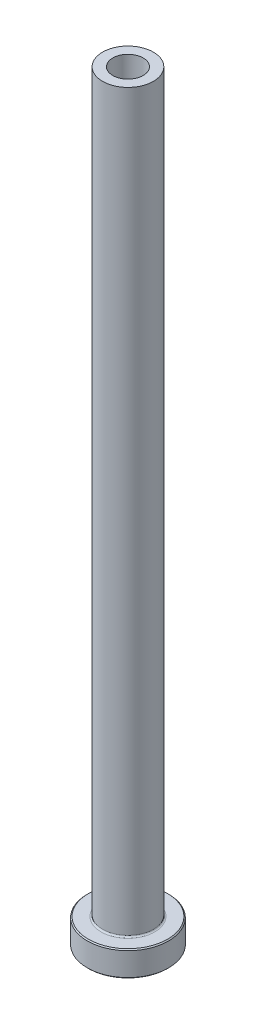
ISO-10303-21;
HEADER;
FILE_DESCRIPTION(('STEP AP214'),'2;1');
FILE_NAME('part.step','',(''),(''),'','','');
FILE_SCHEMA(('AUTOMOTIVE_DESIGN { 1 0 10303 214 1 1 1 1 }'));
ENDSEC;
DATA;
#1=APPLICATION_CONTEXT('core data for automotive mechanical design processes');
#2=APPLICATION_PROTOCOL_DEFINITION('international standard','automotive_design',2000,#1);
#3=PRODUCT_CONTEXT('',#1,'mechanical');
#4=PRODUCT('Part','Part','',(#3));
#5=PRODUCT_RELATED_PRODUCT_CATEGORY('part','',(#4));
#6=PRODUCT_DEFINITION_FORMATION('','',#4);
#7=PRODUCT_DEFINITION_CONTEXT('part definition',#1,'design');
#8=PRODUCT_DEFINITION('design','',#6,#7);
#9=PRODUCT_DEFINITION_SHAPE('','',#8);
#10=(LENGTH_UNIT() NAMED_UNIT(*) SI_UNIT(.MILLI.,.METRE.));
#11=(NAMED_UNIT(*) PLANE_ANGLE_UNIT() SI_UNIT($,.RADIAN.));
#12=(NAMED_UNIT(*) SI_UNIT($,.STERADIAN.) SOLID_ANGLE_UNIT());
#13=UNCERTAINTY_MEASURE_WITH_UNIT(LENGTH_MEASURE(1.E-05),#10,'distance_accuracy_value','');
#14=(GEOMETRIC_REPRESENTATION_CONTEXT(3) GLOBAL_UNCERTAINTY_ASSIGNED_CONTEXT((#13)) GLOBAL_UNIT_ASSIGNED_CONTEXT((#10,
#11,#12)) REPRESENTATION_CONTEXT('',''));
#15=CARTESIAN_POINT('',(0.,0.,0.));
#16=DIRECTION('',(0.,0.,1.));
#17=DIRECTION('',(1.,0.,0.));
#18=AXIS2_PLACEMENT_3D('',#15,#16,#17);
#19=CARTESIAN_POINT('',(0.,92.1876809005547,0.));
#20=DIRECTION('',(0.,1.,0.));
#21=DIRECTION('',(0.,0.,1.));
#22=AXIS2_PLACEMENT_3D('',#19,#20,#21);
#23=CYLINDRICAL_SURFACE('',#22,3.);
#24=CARTESIAN_POINT('',(0.,150.,0.));
#25=DIRECTION('',(0.,1.,0.));
#26=DIRECTION('',(0.,0.,1.));
#27=AXIS2_PLACEMENT_3D('',#24,#25,#26);
#28=CIRCLE('',#27,3.);
#29=CARTESIAN_POINT('',(0.,150.,3.));
#30=VERTEX_POINT('',#29);
#31=EDGE_CURVE('E62',#30,#30,#28,.T.);
#32=ORIENTED_EDGE('',*,*,#31,.T.);
#33=EDGE_LOOP('',(#32));
#34=FACE_BOUND('',#33,.T.);
#35=CARTESIAN_POINT('',(0.,105.,0.));
#36=DIRECTION('',(0.,1.,0.));
#37=DIRECTION('',(0.,0.,1.));
#38=AXIS2_PLACEMENT_3D('',#35,#36,#37);
#39=CIRCLE('',#38,3.);
#40=CARTESIAN_POINT('',(0.,105.,3.));
#41=VERTEX_POINT('',#40);
#42=EDGE_CURVE('E71',#41,#41,#39,.T.);
#43=ORIENTED_EDGE('',*,*,#42,.F.);
#44=EDGE_LOOP('',(#43));
#45=FACE_BOUND('',#44,.T.);
#46=ADVANCED_FACE('F30',(#34,#45),#23,.F.);
#47=CARTESIAN_POINT('',(-3.,150.,0.));
#48=DIRECTION('',(0.,1.,0.));
#49=DIRECTION('',(0.,0.,1.));
#50=AXIS2_PLACEMENT_3D('',#47,#48,#49);
#51=PLANE('',#50);
#52=CARTESIAN_POINT('',(0.,150.,0.));
#53=DIRECTION('',(0.,1.,0.));
#54=DIRECTION('',(0.,0.,1.));
#55=AXIS2_PLACEMENT_3D('',#52,#53,#54);
#56=CIRCLE('',#55,5.00000000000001);
#57=CARTESIAN_POINT('',(0.,150.,5.00000000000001));
#58=VERTEX_POINT('',#57);
#59=EDGE_CURVE('E65',#58,#58,#56,.T.);
#60=ORIENTED_EDGE('',*,*,#59,.T.);
#61=EDGE_LOOP('',(#60));
#62=FACE_BOUND('',#61,.T.);
#63=ORIENTED_EDGE('',*,*,#31,.F.);
#64=EDGE_LOOP('',(#63));
#65=FACE_BOUND('',#64,.T.);
#66=ADVANCED_FACE('F79',(#62,#65),#51,.T.);
#67=CARTESIAN_POINT('',(0.,92.1876809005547,0.));
#68=DIRECTION('',(0.,1.,0.));
#69=DIRECTION('',(0.,0.,1.));
#70=AXIS2_PLACEMENT_3D('',#67,#68,#69);
#71=CYLINDRICAL_SURFACE('',#70,5.);
#72=CARTESIAN_POINT('',(0.,5.3,0.));
#73=DIRECTION('',(0.,1.,0.));
#74=DIRECTION('',(0.,0.,1.));
#75=AXIS2_PLACEMENT_3D('',#72,#73,#74);
#76=CIRCLE('',#75,5.);
#77=CARTESIAN_POINT('',(0.,5.3,5.));
#78=VERTEX_POINT('',#77);
#79=EDGE_CURVE('E59',#78,#78,#76,.T.);
#80=ORIENTED_EDGE('',*,*,#79,.T.);
#81=EDGE_LOOP('',(#80));
#82=FACE_BOUND('',#81,.T.);
#83=ORIENTED_EDGE('',*,*,#59,.F.);
#84=EDGE_LOOP('',(#83));
#85=FACE_BOUND('',#84,.T.);
#86=ADVANCED_FACE('F85',(#82,#85),#71,.T.);
#87=CARTESIAN_POINT('',(-4.99999999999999,5.,0.));
#88=DIRECTION('',(0.,1.,0.));
#89=DIRECTION('',(0.,0.,1.));
#90=AXIS2_PLACEMENT_3D('',#87,#88,#89);
#91=PLANE('',#90);
#92=CARTESIAN_POINT('',(0.,5.,0.));
#93=DIRECTION('',(0.,1.,0.));
#94=DIRECTION('',(0.,0.,1.));
#95=AXIS2_PLACEMENT_3D('',#92,#93,#94);
#96=CIRCLE('',#95,7.79999999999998);
#97=CARTESIAN_POINT('',(0.,5.,7.79999999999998));
#98=VERTEX_POINT('',#97);
#99=EDGE_CURVE('E53',#98,#98,#96,.T.);
#100=ORIENTED_EDGE('',*,*,#99,.T.);
#101=EDGE_LOOP('',(#100));
#102=FACE_BOUND('',#101,.T.);
#103=CARTESIAN_POINT('',(0.,5.,0.));
#104=DIRECTION('',(0.,1.,0.));
#105=DIRECTION('',(0.,0.,1.));
#106=AXIS2_PLACEMENT_3D('',#103,#104,#105);
#107=CIRCLE('',#106,5.3);
#108=CARTESIAN_POINT('',(0.,5.,5.3));
#109=VERTEX_POINT('',#108);
#110=EDGE_CURVE('E56',#109,#109,#107,.F.);
#111=ORIENTED_EDGE('',*,*,#110,.T.);
#112=EDGE_LOOP('',(#111));
#113=FACE_BOUND('',#112,.T.);
#114=ADVANCED_FACE('F111',(#102,#113),#91,.T.);
#115=CARTESIAN_POINT('',(0.,92.1876809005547,0.));
#116=DIRECTION('',(0.,1.,0.));
#117=DIRECTION('',(0.,0.,1.));
#118=AXIS2_PLACEMENT_3D('',#115,#116,#117);
#119=CYLINDRICAL_SURFACE('',#118,7.99999999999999);
#120=CARTESIAN_POINT('',(0.,4.79999999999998,0.));
#121=DIRECTION('',(0.,1.,0.));
#122=DIRECTION('',(0.,0.,1.));
#123=AXIS2_PLACEMENT_3D('',#120,#121,#122);
#124=CIRCLE('',#123,7.99999999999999);
#125=CARTESIAN_POINT('',(0.,4.79999999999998,7.99999999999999));
#126=VERTEX_POINT('',#125);
#127=EDGE_CURVE('E45',#126,#126,#124,.F.);
#128=ORIENTED_EDGE('',*,*,#127,.T.);
#129=EDGE_LOOP('',(#128));
#130=FACE_BOUND('',#129,.T.);
#131=CARTESIAN_POINT('',(0.,0.200000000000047,0.));
#132=DIRECTION('',(0.,-1.,0.));
#133=DIRECTION('',(0.,0.,-1.));
#134=AXIS2_PLACEMENT_3D('',#131,#132,#133);
#135=CIRCLE('',#134,7.99999999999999);
#136=CARTESIAN_POINT('',(0.,0.200000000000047,-7.99999999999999));
#137=VERTEX_POINT('',#136);
#138=EDGE_CURVE('E50',#137,#137,#135,.F.);
#139=ORIENTED_EDGE('',*,*,#138,.T.);
#140=EDGE_LOOP('',(#139));
#141=FACE_BOUND('',#140,.T.);
#142=ADVANCED_FACE('F108',(#130,#141),#119,.T.);
#143=CARTESIAN_POINT('',(-7.99999999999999,0.,0.));
#144=DIRECTION('',(0.,-1.,0.));
#145=DIRECTION('',(0.,0.,-1.));
#146=AXIS2_PLACEMENT_3D('',#143,#144,#145);
#147=PLANE('',#146);
#148=CARTESIAN_POINT('',(0.,0.,0.));
#149=DIRECTION('',(0.,-1.,0.));
#150=DIRECTION('',(0.,0.,-1.));
#151=AXIS2_PLACEMENT_3D('',#148,#149,#150);
#152=CIRCLE('',#151,3.74999999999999);
#153=CARTESIAN_POINT('',(0.,0.,-3.74999999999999));
#154=VERTEX_POINT('',#153);
#155=EDGE_CURVE('E37',#154,#154,#152,.F.);
#156=ORIENTED_EDGE('',*,*,#155,.T.);
#157=EDGE_LOOP('',(#156));
#158=FACE_BOUND('',#157,.T.);
#159=CARTESIAN_POINT('',(0.,0.,0.));
#160=DIRECTION('',(0.,-1.,0.));
#161=DIRECTION('',(0.,0.,-1.));
#162=AXIS2_PLACEMENT_3D('',#159,#160,#161);
#163=CIRCLE('',#162,7.79999999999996);
#164=CARTESIAN_POINT('',(0.,0.,-7.79999999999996));
#165=VERTEX_POINT('',#164);
#166=EDGE_CURVE('E41',#165,#165,#163,.T.);
#167=ORIENTED_EDGE('',*,*,#166,.T.);
#168=EDGE_LOOP('',(#167));
#169=FACE_BOUND('',#168,.T.);
#170=ADVANCED_FACE('F110',(#158,#169),#147,.T.);
#171=CARTESIAN_POINT('',(0.,92.1876809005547,0.));
#172=DIRECTION('',(0.,1.,0.));
#173=DIRECTION('',(0.,0.,1.));
#174=AXIS2_PLACEMENT_3D('',#171,#172,#173);
#175=CYLINDRICAL_SURFACE('',#174,3.25);
#176=CARTESIAN_POINT('',(0.,0.5,0.));
#177=DIRECTION('',(0.,-1.,0.));
#178=DIRECTION('',(0.,0.,-1.));
#179=AXIS2_PLACEMENT_3D('',#176,#177,#178);
#180=CIRCLE('',#179,3.25);
#181=CARTESIAN_POINT('',(0.,0.5,-3.25));
#182=VERTEX_POINT('',#181);
#183=EDGE_CURVE('E10',#182,#182,#180,.T.);
#184=ORIENTED_EDGE('',*,*,#183,.T.);
#185=EDGE_LOOP('',(#184));
#186=FACE_BOUND('',#185,.T.);
#187=CARTESIAN_POINT('',(0.,93.,0.));
#188=DIRECTION('',(0.,1.,0.));
#189=DIRECTION('',(0.,0.,1.));
#190=AXIS2_PLACEMENT_3D('',#187,#188,#189);
#191=CIRCLE('',#190,3.25);
#192=CARTESIAN_POINT('',(0.,93.,3.25));
#193=VERTEX_POINT('',#192);
#194=EDGE_CURVE('E68',#193,#193,#191,.T.);
#195=ORIENTED_EDGE('',*,*,#194,.T.);
#196=EDGE_LOOP('',(#195));
#197=FACE_BOUND('',#196,.T.);
#198=ADVANCED_FACE('F118',(#186,#197),#175,.F.);
#199=CARTESIAN_POINT('',(0.,93.,0.));
#200=DIRECTION('',(0.,-1.,0.));
#201=DIRECTION('',(0.,0.,-1.));
#202=AXIS2_PLACEMENT_3D('',#199,#200,#201);
#203=CONICAL_SURFACE('',#202,3.25,0.0208303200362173);
#204=ORIENTED_EDGE('',*,*,#42,.T.);
#205=EDGE_LOOP('',(#204));
#206=FACE_BOUND('',#205,.T.);
#207=ORIENTED_EDGE('',*,*,#194,.F.);
#208=EDGE_LOOP('',(#207));
#209=FACE_BOUND('',#208,.T.);
#210=ADVANCED_FACE('F75',(#206,#209),#203,.F.);
#211=CARTESIAN_POINT('',(0.,5.3,0.));
#212=DIRECTION('',(0.,1.,0.));
#213=DIRECTION('',(0.,0.,1.));
#214=AXIS2_PLACEMENT_3D('',#211,#212,#213);
#215=TOROIDAL_SURFACE('',#214,5.3,0.3);
#216=ORIENTED_EDGE('',*,*,#110,.F.);
#217=EDGE_LOOP('',(#216));
#218=FACE_BOUND('',#217,.T.);
#219=ORIENTED_EDGE('',*,*,#79,.F.);
#220=EDGE_LOOP('',(#219));
#221=FACE_BOUND('',#220,.T.);
#222=ADVANCED_FACE('F90',(#218,#221),#215,.F.);
#223=CARTESIAN_POINT('',(0.,5.,0.));
#224=DIRECTION('',(0.,-1.,0.));
#225=DIRECTION('',(0.,0.,-1.));
#226=AXIS2_PLACEMENT_3D('',#223,#224,#225);
#227=CONICAL_SURFACE('',#226,7.79999999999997,0.78539816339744);
#228=ORIENTED_EDGE('',*,*,#127,.F.);
#229=EDGE_LOOP('',(#228));
#230=FACE_BOUND('',#229,.T.);
#231=ORIENTED_EDGE('',*,*,#99,.F.);
#232=EDGE_LOOP('',(#231));
#233=FACE_BOUND('',#232,.T.);
#234=ADVANCED_FACE('F93',(#230,#233),#227,.T.);
#235=CARTESIAN_POINT('',(0.,0.200000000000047,0.));
#236=DIRECTION('',(0.,1.,0.));
#237=DIRECTION('',(0.,0.,1.));
#238=AXIS2_PLACEMENT_3D('',#235,#236,#237);
#239=CONICAL_SURFACE('',#238,7.99999999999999,0.785398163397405);
#240=ORIENTED_EDGE('',*,*,#166,.F.);
#241=EDGE_LOOP('',(#240));
#242=FACE_BOUND('',#241,.T.);
#243=ORIENTED_EDGE('',*,*,#138,.F.);
#244=EDGE_LOOP('',(#243));
#245=FACE_BOUND('',#244,.T.);
#246=ADVANCED_FACE('F96',(#242,#245),#239,.T.);
#247=CARTESIAN_POINT('',(0.,0.,0.));
#248=DIRECTION('',(0.,-1.,0.));
#249=DIRECTION('',(0.,0.,-1.));
#250=AXIS2_PLACEMENT_3D('',#247,#248,#249);
#251=CONICAL_SURFACE('',#250,3.74999999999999,0.785398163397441);
#252=ORIENTED_EDGE('',*,*,#183,.F.);
#253=EDGE_LOOP('',(#252));
#254=FACE_BOUND('',#253,.T.);
#255=ORIENTED_EDGE('',*,*,#155,.F.);
#256=EDGE_LOOP('',(#255));
#257=FACE_BOUND('',#256,.T.);
#258=ADVANCED_FACE('F32',(#254,#257),#251,.F.);
#259=CLOSED_SHELL('',(#46,#66,#86,#114,#142,#170,#198,#210,#222,#234,#246,#258));
#260=MANIFOLD_SOLID_BREP('B2',#259);
#261=ADVANCED_BREP_SHAPE_REPRESENTATION('',(#18,#260),#14);
#262=SHAPE_DEFINITION_REPRESENTATION(#9,#261);
ENDSEC;
END-ISO-10303-21;
